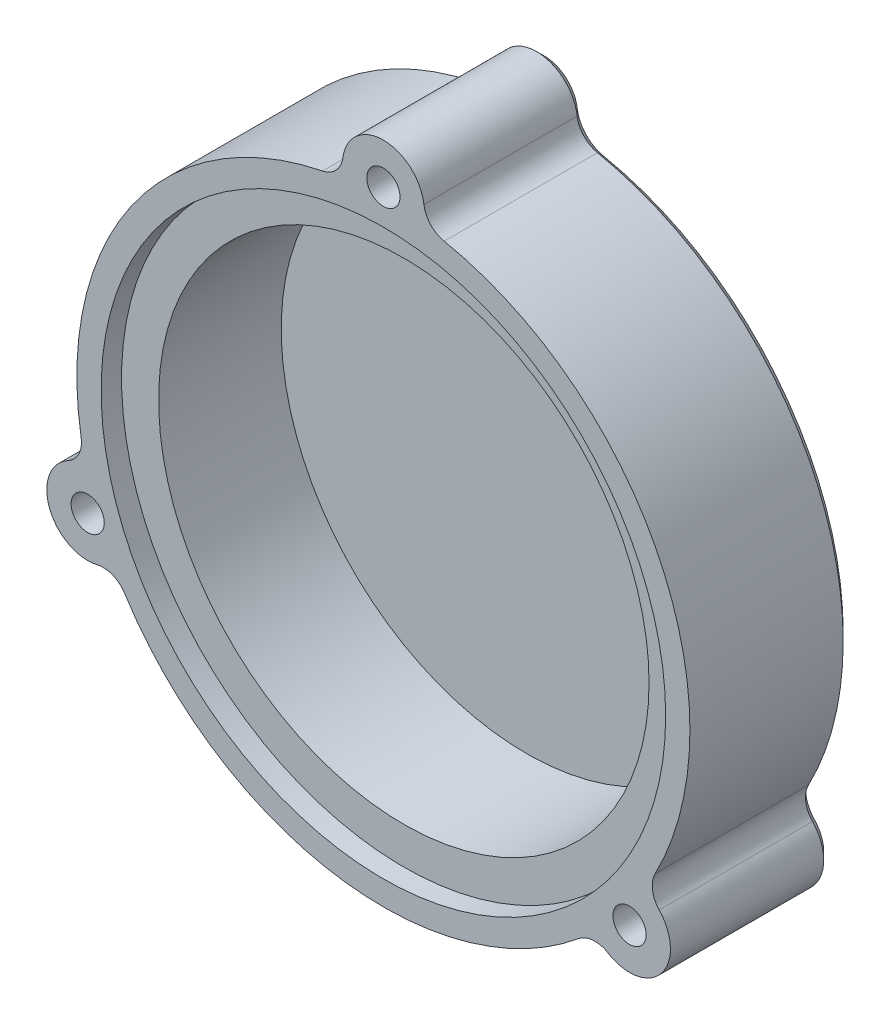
ISO-10303-21;
HEADER;
FILE_DESCRIPTION(('STEP AP214'),'2;1');
FILE_NAME('part.step','',(''),(''),'','','');
FILE_SCHEMA(('AUTOMOTIVE_DESIGN { 1 0 10303 214 1 1 1 1 }'));
ENDSEC;
DATA;
#1=APPLICATION_CONTEXT('core data for automotive mechanical design processes');
#2=APPLICATION_PROTOCOL_DEFINITION('international standard','automotive_design',2000,#1);
#3=PRODUCT_CONTEXT('',#1,'mechanical');
#4=PRODUCT('Part','Part','',(#3));
#5=PRODUCT_RELATED_PRODUCT_CATEGORY('part','',(#4));
#6=PRODUCT_DEFINITION_FORMATION('','',#4);
#7=PRODUCT_DEFINITION_CONTEXT('part definition',#1,'design');
#8=PRODUCT_DEFINITION('design','',#6,#7);
#9=PRODUCT_DEFINITION_SHAPE('','',#8);
#10=(LENGTH_UNIT() NAMED_UNIT(*) SI_UNIT(.MILLI.,.METRE.));
#11=(NAMED_UNIT(*) PLANE_ANGLE_UNIT() SI_UNIT($,.RADIAN.));
#12=(NAMED_UNIT(*) SI_UNIT($,.STERADIAN.) SOLID_ANGLE_UNIT());
#13=UNCERTAINTY_MEASURE_WITH_UNIT(LENGTH_MEASURE(1.E-05),#10,'distance_accuracy_value','');
#14=(GEOMETRIC_REPRESENTATION_CONTEXT(3) GLOBAL_UNCERTAINTY_ASSIGNED_CONTEXT((#13)) GLOBAL_UNIT_ASSIGNED_CONTEXT((#10,
#11,#12)) REPRESENTATION_CONTEXT('',''));
#15=CARTESIAN_POINT('',(0.,0.,0.));
#16=DIRECTION('',(0.,0.,1.));
#17=DIRECTION('',(1.,0.,0.));
#18=AXIS2_PLACEMENT_3D('',#15,#16,#17);
#19=CARTESIAN_POINT('',(-57.8819864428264,-22.2188128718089,0.));
#20=DIRECTION('',(0.,0.,1.));
#21=DIRECTION('',(1.,0.,0.));
#22=AXIS2_PLACEMENT_3D('',#19,#20,#21);
#23=CYLINDRICAL_SURFACE('',#22,3.25);
#24=CARTESIAN_POINT('',(-57.8819864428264,-22.2188128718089,31.5));
#25=DIRECTION('',(0.,0.,1.));
#26=DIRECTION('',(1.,0.,0.));
#27=AXIS2_PLACEMENT_3D('',#24,#25,#26);
#28=CIRCLE('',#27,3.25);
#29=CARTESIAN_POINT('',(-54.6319864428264,-22.2188128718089,31.5));
#30=VERTEX_POINT('',#29);
#31=EDGE_CURVE('E334',#30,#30,#28,.T.);
#32=ORIENTED_EDGE('',*,*,#31,.T.);
#33=EDGE_LOOP('',(#32));
#34=FACE_BOUND('',#33,.T.);
#35=CARTESIAN_POINT('',(-57.8819864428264,-22.2188128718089,15.));
#36=DIRECTION('',(0.,0.,-1.));
#37=DIRECTION('',(-1.,0.,0.));
#38=AXIS2_PLACEMENT_3D('',#35,#36,#37);
#39=CIRCLE('',#38,3.25);
#40=CARTESIAN_POINT('',(-61.1319864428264,-22.2188128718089,15.));
#41=VERTEX_POINT('',#40);
#42=EDGE_CURVE('E329',#41,#41,#39,.F.);
#43=ORIENTED_EDGE('',*,*,#42,.F.);
#44=EDGE_LOOP('',(#43));
#45=FACE_BOUND('',#44,.T.);
#46=ADVANCED_FACE('F41',(#34,#45),#23,.F.);
#47=CARTESIAN_POINT('',(48.183049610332,-39.0178642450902,0.));
#48=DIRECTION('',(0.,0.,1.));
#49=DIRECTION('',(1.,0.,0.));
#50=AXIS2_PLACEMENT_3D('',#47,#48,#49);
#51=CYLINDRICAL_SURFACE('',#50,3.25);
#52=CARTESIAN_POINT('',(48.183049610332,-39.0178642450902,31.5));
#53=DIRECTION('',(0.,0.,1.));
#54=DIRECTION('',(1.,0.,0.));
#55=AXIS2_PLACEMENT_3D('',#52,#53,#54);
#56=CIRCLE('',#55,3.25);
#57=CARTESIAN_POINT('',(51.433049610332,-39.0178642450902,31.5));
#58=VERTEX_POINT('',#57);
#59=EDGE_CURVE('E330',#58,#58,#56,.T.);
#60=ORIENTED_EDGE('',*,*,#59,.T.);
#61=EDGE_LOOP('',(#60));
#62=FACE_BOUND('',#61,.T.);
#63=CARTESIAN_POINT('',(48.183049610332,-39.0178642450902,15.));
#64=DIRECTION('',(0.,0.,-1.));
#65=DIRECTION('',(-1.,0.,0.));
#66=AXIS2_PLACEMENT_3D('',#63,#64,#65);
#67=CIRCLE('',#66,3.25);
#68=CARTESIAN_POINT('',(44.933049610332,-39.0178642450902,15.));
#69=VERTEX_POINT('',#68);
#70=EDGE_CURVE('E366',#69,#69,#67,.F.);
#71=ORIENTED_EDGE('',*,*,#70,.F.);
#72=EDGE_LOOP('',(#71));
#73=FACE_BOUND('',#72,.T.);
#74=ADVANCED_FACE('F375',(#62,#73),#51,.F.);
#75=CARTESIAN_POINT('',(0.,62.,0.));
#76=DIRECTION('',(0.,0.,1.));
#77=DIRECTION('',(1.,0.,0.));
#78=AXIS2_PLACEMENT_3D('',#75,#76,#77);
#79=CYLINDRICAL_SURFACE('',#78,3.25);
#80=CARTESIAN_POINT('',(0.,62.,31.5));
#81=DIRECTION('',(0.,0.,1.));
#82=DIRECTION('',(1.,0.,0.));
#83=AXIS2_PLACEMENT_3D('',#80,#81,#82);
#84=CIRCLE('',#83,3.25);
#85=CARTESIAN_POINT('',(3.25,62.,31.5));
#86=VERTEX_POINT('',#85);
#87=EDGE_CURVE('E333',#86,#86,#84,.T.);
#88=ORIENTED_EDGE('',*,*,#87,.T.);
#89=EDGE_LOOP('',(#88));
#90=FACE_BOUND('',#89,.T.);
#91=CARTESIAN_POINT('',(0.,62.,15.));
#92=DIRECTION('',(0.,0.,-1.));
#93=DIRECTION('',(-1.,0.,0.));
#94=AXIS2_PLACEMENT_3D('',#91,#92,#93);
#95=CIRCLE('',#94,3.25);
#96=CARTESIAN_POINT('',(-3.25,62.,15.));
#97=VERTEX_POINT('',#96);
#98=EDGE_CURVE('E325',#97,#97,#95,.F.);
#99=ORIENTED_EDGE('',*,*,#98,.F.);
#100=EDGE_LOOP('',(#99));
#101=FACE_BOUND('',#100,.T.);
#102=ADVANCED_FACE('F381',(#90,#101),#79,.F.);
#103=CARTESIAN_POINT('',(0.,62.,31.5));
#104=DIRECTION('',(0.,0.,-1.));
#105=DIRECTION('',(-1.,0.,0.));
#106=AXIS2_PLACEMENT_3D('',#103,#104,#105);
#107=CYLINDRICAL_SURFACE('',#106,8.);
#108=DIRECTION('',(0.,0.,-1.));
#109=VECTOR('',#108,1.);
#110=CARTESIAN_POINT('',(7.93051488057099,63.0521091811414,31.5));
#111=LINE('',#110,#109);
#112=CARTESIAN_POINT('',(7.93051488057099,63.0521091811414,31.5));
#113=VERTEX_POINT('',#112);
#114=CARTESIAN_POINT('',(7.93051488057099,63.0521091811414,1.49999999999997));
#115=VERTEX_POINT('',#114);
#116=EDGE_CURVE('E216',#113,#115,#111,.T.);
#117=ORIENTED_EDGE('',*,*,#116,.T.);
#118=CARTESIAN_POINT('',(0.,62.,1.49999999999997));
#119=DIRECTION('',(0.,0.,1.));
#120=DIRECTION('',(1.,0.,0.));
#121=AXIS2_PLACEMENT_3D('',#118,#119,#120);
#122=CIRCLE('',#121,8.);
#123=CARTESIAN_POINT('',(-7.93051488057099,63.0521091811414,1.49999999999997));
#124=VERTEX_POINT('',#123);
#125=EDGE_CURVE('E268',#115,#124,#122,.T.);
#126=ORIENTED_EDGE('',*,*,#125,.T.);
#127=DIRECTION('',(0.,0.,-1.));
#128=VECTOR('',#127,1.);
#129=CARTESIAN_POINT('',(-7.93051488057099,63.0521091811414,31.5));
#130=LINE('',#129,#128);
#131=CARTESIAN_POINT('',(-7.93051488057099,63.0521091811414,31.5));
#132=VERTEX_POINT('',#131);
#133=EDGE_CURVE('E180',#124,#132,#130,.F.);
#134=ORIENTED_EDGE('',*,*,#133,.T.);
#135=CARTESIAN_POINT('',(0.,62.,31.5));
#136=DIRECTION('',(0.,0.,1.));
#137=DIRECTION('',(1.,0.,0.));
#138=AXIS2_PLACEMENT_3D('',#135,#136,#137);
#139=CIRCLE('',#138,8.);
#140=EDGE_CURVE('E346',#113,#132,#139,.T.);
#141=ORIENTED_EDGE('',*,*,#140,.F.);
#142=EDGE_LOOP('',(#117,#126,#134,#141));
#143=FACE_BOUND('',#142,.T.);
#144=ADVANCED_FACE('F388',(#143),#107,.T.);
#145=CARTESIAN_POINT('',(0.,0.,31.5));
#146=DIRECTION('',(0.,0.,-1.));
#147=DIRECTION('',(-1.,0.,0.));
#148=AXIS2_PLACEMENT_3D('',#145,#146,#147);
#149=CYLINDRICAL_SURFACE('',#148,60.);
#150=DIRECTION('',(0.,0.,-1.));
#151=VECTOR('',#150,1.);
#152=CARTESIAN_POINT('',(-11.8957723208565,58.8089330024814,31.5));
#153=LINE('',#152,#151);
#154=CARTESIAN_POINT('',(-11.8957723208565,58.8089330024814,31.5));
#155=VERTEX_POINT('',#154);
#156=CARTESIAN_POINT('',(-11.8957723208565,58.8089330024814,1.49999999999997));
#157=VERTEX_POINT('',#156);
#158=EDGE_CURVE('E212',#155,#157,#153,.T.);
#159=ORIENTED_EDGE('',*,*,#158,.T.);
#160=CARTESIAN_POINT('',(0.,0.,1.49999999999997));
#161=DIRECTION('',(0.,0.,1.));
#162=DIRECTION('',(1.,0.,0.));
#163=AXIS2_PLACEMENT_3D('',#160,#161,#162);
#164=CIRCLE('',#163,60.);
#165=CARTESIAN_POINT('',(-59.165932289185,-9.96957653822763,1.49999999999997));
#166=VERTEX_POINT('',#165);
#167=EDGE_CURVE('E11',#157,#166,#164,.T.);
#168=ORIENTED_EDGE('',*,*,#167,.T.);
#169=DIRECTION('',(0.,0.,-1.));
#170=VECTOR('',#169,1.);
#171=CARTESIAN_POINT('',(-59.165932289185,-9.96957653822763,31.5));
#172=LINE('',#171,#170);
#173=CARTESIAN_POINT('',(-59.165932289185,-9.96957653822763,31.5));
#174=VERTEX_POINT('',#173);
#175=EDGE_CURVE('E214',#166,#174,#172,.F.);
#176=ORIENTED_EDGE('',*,*,#175,.T.);
#177=CARTESIAN_POINT('',(0.,0.,31.5));
#178=DIRECTION('',(0.,0.,1.));
#179=DIRECTION('',(1.,0.,0.));
#180=AXIS2_PLACEMENT_3D('',#177,#178,#179);
#181=CIRCLE('',#180,60.);
#182=EDGE_CURVE('E352',#155,#174,#181,.T.);
#183=ORIENTED_EDGE('',*,*,#182,.F.);
#184=EDGE_LOOP('',(#159,#168,#176,#183));
#185=FACE_BOUND('',#184,.T.);
#186=ADVANCED_FACE('F427',(#185),#149,.T.);
#187=CARTESIAN_POINT('',(-57.8819864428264,-22.2188128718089,31.5));
#188=DIRECTION('',(0.,0.,-1.));
#189=DIRECTION('',(-1.,0.,0.));
#190=AXIS2_PLACEMENT_3D('',#187,#188,#189);
#191=CYLINDRICAL_SURFACE('',#190,8.);
#192=DIRECTION('',(0.,0.,-1.));
#193=VECTOR('',#192,1.);
#194=CARTESIAN_POINT('',(-61.7062573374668,-15.1920816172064,31.5));
#195=LINE('',#194,#193);
#196=CARTESIAN_POINT('',(-61.7062573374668,-15.1920816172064,31.5));
#197=VERTEX_POINT('',#196);
#198=CARTESIAN_POINT('',(-61.7062573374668,-15.1920816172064,1.49999999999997));
#199=VERTEX_POINT('',#198);
#200=EDGE_CURVE('E209',#197,#199,#195,.T.);
#201=ORIENTED_EDGE('',*,*,#200,.T.);
#202=CARTESIAN_POINT('',(-57.8819864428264,-22.2188128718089,1.49999999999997));
#203=DIRECTION('',(0.,0.,1.));
#204=DIRECTION('',(1.,0.,0.));
#205=AXIS2_PLACEMENT_3D('',#202,#203,#204);
#206=CIRCLE('',#205,8.);
#207=CARTESIAN_POINT('',(-56.0221726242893,-29.9996285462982,1.49999999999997));
#208=VERTEX_POINT('',#207);
#209=EDGE_CURVE('E270',#199,#208,#206,.T.);
#210=ORIENTED_EDGE('',*,*,#209,.T.);
#211=DIRECTION('',(0.,0.,-1.));
#212=VECTOR('',#211,1.);
#213=CARTESIAN_POINT('',(-56.0221726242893,-29.9996285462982,31.5));
#214=LINE('',#213,#212);
#215=CARTESIAN_POINT('',(-56.0221726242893,-29.9996285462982,31.5));
#216=VERTEX_POINT('',#215);
#217=EDGE_CURVE('E207',#208,#216,#214,.F.);
#218=ORIENTED_EDGE('',*,*,#217,.T.);
#219=CARTESIAN_POINT('',(-57.8819864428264,-22.2188128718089,31.5));
#220=DIRECTION('',(0.,0.,1.));
#221=DIRECTION('',(1.,0.,0.));
#222=AXIS2_PLACEMENT_3D('',#219,#220,#221);
#223=CIRCLE('',#222,8.);
#224=EDGE_CURVE('E355',#197,#216,#223,.T.);
#225=ORIENTED_EDGE('',*,*,#224,.F.);
#226=EDGE_LOOP('',(#201,#210,#218,#225));
#227=FACE_BOUND('',#226,.T.);
#228=ADVANCED_FACE('F423',(#227),#191,.T.);
#229=CARTESIAN_POINT('',(0.,0.,31.5));
#230=DIRECTION('',(0.,0.,-1.));
#231=DIRECTION('',(-1.,0.,0.));
#232=AXIS2_PLACEMENT_3D('',#229,#230,#231);
#233=CYLINDRICAL_SURFACE('',#232,60.);
#234=DIRECTION('',(0.,0.,-1.));
#235=VECTOR('',#234,1.);
#236=CARTESIAN_POINT('',(-50.6398052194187,-32.1808969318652,31.5));
#237=LINE('',#236,#235);
#238=CARTESIAN_POINT('',(-50.6398052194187,-32.1808969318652,31.5));
#239=VERTEX_POINT('',#238);
#240=CARTESIAN_POINT('',(-50.6398052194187,-32.1808969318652,1.49999999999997));
#241=VERTEX_POINT('',#240);
#242=EDGE_CURVE('E202',#239,#241,#237,.T.);
#243=ORIENTED_EDGE('',*,*,#242,.T.);
#244=CARTESIAN_POINT('',(0.,0.,1.49999999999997));
#245=DIRECTION('',(0.,0.,1.));
#246=DIRECTION('',(1.,0.,0.));
#247=AXIS2_PLACEMENT_3D('',#244,#245,#246);
#248=CIRCLE('',#247,60.);
#249=CARTESIAN_POINT('',(38.2168726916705,-46.2544121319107,1.49999999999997));
#250=VERTEX_POINT('',#249);
#251=EDGE_CURVE('E262',#241,#250,#248,.T.);
#252=ORIENTED_EDGE('',*,*,#251,.T.);
#253=DIRECTION('',(0.,0.,-1.));
#254=VECTOR('',#253,1.);
#255=CARTESIAN_POINT('',(38.2168726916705,-46.2544121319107,31.5));
#256=LINE('',#255,#254);
#257=CARTESIAN_POINT('',(38.2168726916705,-46.2544121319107,31.5));
#258=VERTEX_POINT('',#257);
#259=EDGE_CURVE('E205',#250,#258,#256,.F.);
#260=ORIENTED_EDGE('',*,*,#259,.T.);
#261=CARTESIAN_POINT('',(0.,0.,31.5));
#262=DIRECTION('',(0.,0.,1.));
#263=DIRECTION('',(1.,0.,0.));
#264=AXIS2_PLACEMENT_3D('',#261,#262,#263);
#265=CIRCLE('',#264,60.);
#266=EDGE_CURVE('E358',#239,#258,#265,.T.);
#267=ORIENTED_EDGE('',*,*,#266,.F.);
#268=EDGE_LOOP('',(#243,#252,#260,#267));
#269=FACE_BOUND('',#268,.T.);
#270=ADVANCED_FACE('F419',(#269),#233,.T.);
#271=CARTESIAN_POINT('',(48.183049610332,-39.0178642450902,31.5));
#272=DIRECTION('',(0.,0.,-1.));
#273=DIRECTION('',(-1.,0.,0.));
#274=AXIS2_PLACEMENT_3D('',#271,#272,#273);
#275=CYLINDRICAL_SURFACE('',#274,8.);
#276=DIRECTION('',(0.,0.,-1.));
#277=VECTOR('',#276,1.);
#278=CARTESIAN_POINT('',(44.0098572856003,-45.8431456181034,31.5));
#279=LINE('',#278,#277);
#280=CARTESIAN_POINT('',(44.0098572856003,-45.8431456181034,31.5));
#281=VERTEX_POINT('',#280);
#282=CARTESIAN_POINT('',(44.0098572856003,-45.8431456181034,1.49999999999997));
#283=VERTEX_POINT('',#282);
#284=EDGE_CURVE('E193',#281,#283,#279,.T.);
#285=ORIENTED_EDGE('',*,*,#284,.T.);
#286=CARTESIAN_POINT('',(48.183049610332,-39.0178642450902,1.49999999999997));
#287=DIRECTION('',(0.,0.,1.));
#288=DIRECTION('',(1.,0.,0.));
#289=AXIS2_PLACEMENT_3D('',#286,#287,#288);
#290=CIRCLE('',#289,8.);
#291=CARTESIAN_POINT('',(53.9915267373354,-33.5168103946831,1.49999999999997));
#292=VERTEX_POINT('',#291);
#293=EDGE_CURVE('E229',#283,#292,#290,.T.);
#294=ORIENTED_EDGE('',*,*,#293,.T.);
#295=DIRECTION('',(0.,0.,-1.));
#296=VECTOR('',#295,1.);
#297=CARTESIAN_POINT('',(53.9915267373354,-33.5168103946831,31.5));
#298=LINE('',#297,#296);
#299=CARTESIAN_POINT('',(53.9915267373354,-33.5168103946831,31.5));
#300=VERTEX_POINT('',#299);
#301=EDGE_CURVE('E196',#292,#300,#298,.F.);
#302=ORIENTED_EDGE('',*,*,#301,.T.);
#303=CARTESIAN_POINT('',(48.183049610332,-39.0178642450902,31.5));
#304=DIRECTION('',(0.,0.,1.));
#305=DIRECTION('',(1.,0.,0.));
#306=AXIS2_PLACEMENT_3D('',#303,#304,#305);
#307=CIRCLE('',#306,8.);
#308=EDGE_CURVE('E175',#281,#300,#307,.T.);
#309=ORIENTED_EDGE('',*,*,#308,.F.);
#310=EDGE_LOOP('',(#285,#294,#302,#309));
#311=FACE_BOUND('',#310,.T.);
#312=ADVANCED_FACE('F416',(#311),#275,.T.);
#313=CARTESIAN_POINT('',(0.,0.,31.5));
#314=DIRECTION('',(0.,0.,-1.));
#315=DIRECTION('',(-1.,0.,0.));
#316=AXIS2_PLACEMENT_3D('',#313,#314,#315);
#317=CYLINDRICAL_SURFACE('',#316,60.);
#318=DIRECTION('',(0.,0.,-1.));
#319=VECTOR('',#318,1.);
#320=CARTESIAN_POINT('',(53.1893768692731,-27.7649092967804,31.5));
#321=LINE('',#320,#319);
#322=CARTESIAN_POINT('',(53.1893768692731,-27.7649092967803,31.5));
#323=VERTEX_POINT('',#322);
#324=CARTESIAN_POINT('',(53.1893768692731,-27.7649092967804,1.49999999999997));
#325=VERTEX_POINT('',#324);
#326=EDGE_CURVE('E185',#323,#325,#321,.T.);
#327=ORIENTED_EDGE('',*,*,#326,.T.);
#328=CARTESIAN_POINT('',(0.,0.,1.49999999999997));
#329=DIRECTION('',(0.,0.,1.));
#330=DIRECTION('',(1.,0.,0.));
#331=AXIS2_PLACEMENT_3D('',#328,#329,#330);
#332=CIRCLE('',#331,60.);
#333=CARTESIAN_POINT('',(11.8957723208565,58.8089330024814,1.49999999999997));
#334=VERTEX_POINT('',#333);
#335=EDGE_CURVE('E260',#325,#334,#332,.T.);
#336=ORIENTED_EDGE('',*,*,#335,.T.);
#337=DIRECTION('',(0.,0.,-1.));
#338=VECTOR('',#337,1.);
#339=CARTESIAN_POINT('',(11.8957723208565,58.8089330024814,31.5));
#340=LINE('',#339,#338);
#341=CARTESIAN_POINT('',(11.8957723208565,58.8089330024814,31.5));
#342=VERTEX_POINT('',#341);
#343=EDGE_CURVE('E188',#334,#342,#340,.F.);
#344=ORIENTED_EDGE('',*,*,#343,.T.);
#345=CARTESIAN_POINT('',(0.,0.,31.5));
#346=DIRECTION('',(0.,0.,1.));
#347=DIRECTION('',(1.,0.,0.));
#348=AXIS2_PLACEMENT_3D('',#345,#346,#347);
#349=CIRCLE('',#348,60.);
#350=EDGE_CURVE('E172',#323,#342,#349,.T.);
#351=ORIENTED_EDGE('',*,*,#350,.F.);
#352=EDGE_LOOP('',(#327,#336,#344,#351));
#353=FACE_BOUND('',#352,.T.);
#354=ADVANCED_FACE('F184',(#353),#317,.T.);
#355=CARTESIAN_POINT('',(0.,31.,31.5));
#356=DIRECTION('',(0.,0.,1.));
#357=DIRECTION('',(1.,0.,0.));
#358=AXIS2_PLACEMENT_3D('',#355,#356,#357);
#359=PLANE('',#358);
#360=ORIENTED_EDGE('',*,*,#59,.F.);
#361=EDGE_LOOP('',(#360));
#362=FACE_BOUND('',#361,.T.);
#363=ORIENTED_EDGE('',*,*,#31,.F.);
#364=EDGE_LOOP('',(#363));
#365=FACE_BOUND('',#364,.T.);
#366=ORIENTED_EDGE('',*,*,#87,.F.);
#367=EDGE_LOOP('',(#366));
#368=FACE_BOUND('',#367,.T.);
#369=CARTESIAN_POINT('',(0.,0.,31.5));
#370=DIRECTION('',(0.,0.,1.));
#371=DIRECTION('',(1.,0.,0.));
#372=AXIS2_PLACEMENT_3D('',#369,#370,#371);
#373=CIRCLE('',#372,55.25);
#374=CARTESIAN_POINT('',(55.25,0.,31.5));
#375=VERTEX_POINT('',#374);
#376=EDGE_CURVE('E347',#375,#375,#373,.T.);
#377=ORIENTED_EDGE('',*,*,#376,.F.);
#378=EDGE_LOOP('',(#377));
#379=FACE_BOUND('',#378,.T.);
#380=ORIENTED_EDGE('',*,*,#350,.T.);
#381=CARTESIAN_POINT('',(12.8870866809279,63.7096774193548,31.5));
#382=DIRECTION('',(0.,0.,1.));
#383=DIRECTION('',(1.,0.,0.));
#384=AXIS2_PLACEMENT_3D('',#381,#382,#383);
#385=CIRCLE('',#384,5.);
#386=EDGE_CURVE('E227',#342,#113,#385,.F.);
#387=ORIENTED_EDGE('',*,*,#386,.T.);
#388=ORIENTED_EDGE('',*,*,#140,.T.);
#389=CARTESIAN_POINT('',(-12.8870866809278,63.7096774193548,31.5));
#390=DIRECTION('',(0.,0.,1.));
#391=DIRECTION('',(1.,0.,0.));
#392=AXIS2_PLACEMENT_3D('',#389,#390,#391);
#393=CIRCLE('',#392,5.);
#394=EDGE_CURVE('E225',#132,#155,#393,.F.);
#395=ORIENTED_EDGE('',*,*,#394,.T.);
#396=ORIENTED_EDGE('',*,*,#182,.T.);
#397=CARTESIAN_POINT('',(-64.0964266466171,-10.8003745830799,31.5));
#398=DIRECTION('',(0.,0.,1.));
#399=DIRECTION('',(1.,0.,0.));
#400=AXIS2_PLACEMENT_3D('',#397,#398,#399);
#401=CIRCLE('',#400,5.);
#402=EDGE_CURVE('E221',#174,#197,#401,.F.);
#403=ORIENTED_EDGE('',*,*,#402,.T.);
#404=ORIENTED_EDGE('',*,*,#224,.T.);
#405=CARTESIAN_POINT('',(-54.8597889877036,-34.8626383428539,31.5));
#406=DIRECTION('',(0.,0.,1.));
#407=DIRECTION('',(1.,0.,0.));
#408=AXIS2_PLACEMENT_3D('',#405,#406,#407);
#409=CIRCLE('',#408,5.);
#410=EDGE_CURVE('E223',#216,#239,#409,.F.);
#411=ORIENTED_EDGE('',*,*,#410,.T.);
#412=ORIENTED_EDGE('',*,*,#266,.T.);
#413=CARTESIAN_POINT('',(41.4016120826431,-50.1089464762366,31.5));
#414=DIRECTION('',(0.,0.,1.));
#415=DIRECTION('',(1.,0.,0.));
#416=AXIS2_PLACEMENT_3D('',#413,#414,#415);
#417=CIRCLE('',#416,5.);
#418=EDGE_CURVE('E179',#258,#281,#417,.F.);
#419=ORIENTED_EDGE('',*,*,#418,.T.);
#420=ORIENTED_EDGE('',*,*,#308,.T.);
#421=CARTESIAN_POINT('',(57.6218249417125,-30.0786517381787,31.5));
#422=DIRECTION('',(0.,0.,1.));
#423=DIRECTION('',(1.,0.,0.));
#424=AXIS2_PLACEMENT_3D('',#421,#422,#423);
#425=CIRCLE('',#424,5.);
#426=EDGE_CURVE('E169',#300,#323,#425,.F.);
#427=ORIENTED_EDGE('',*,*,#426,.T.);
#428=EDGE_LOOP('',(#380,#387,#388,#395,#396,#403,#404,#411,#412,#419,#420,#427));
#429=FACE_BOUND('',#428,.T.);
#430=ADVANCED_FACE('F171',(#362,#365,#368,#379,#429),#359,.T.);
#431=CARTESIAN_POINT('',(0.,31.,0.));
#432=DIRECTION('',(0.,0.,1.));
#433=DIRECTION('',(1.,0.,0.));
#434=AXIS2_PLACEMENT_3D('',#431,#432,#433);
#435=PLANE('',#434);
#436=CARTESIAN_POINT('',(57.6218249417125,-30.0786517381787,0.));
#437=DIRECTION('',(0.,0.,1.));
#438=DIRECTION('',(1.,0.,0.));
#439=AXIS2_PLACEMENT_3D('',#436,#437,#438);
#440=CIRCLE('',#439,6.49999999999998);
#441=CARTESIAN_POINT('',(51.8596424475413,-27.0707865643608,0.));
#442=VERTEX_POINT('',#441);
#443=CARTESIAN_POINT('',(52.9024372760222,-34.5482579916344,0.));
#444=VERTEX_POINT('',#443);
#445=EDGE_CURVE('E252',#442,#444,#440,.T.);
#446=ORIENTED_EDGE('',*,*,#445,.T.);
#447=CARTESIAN_POINT('',(48.183049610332,-39.0178642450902,0.));
#448=DIRECTION('',(0.,0.,1.));
#449=DIRECTION('',(1.,0.,0.));
#450=AXIS2_PLACEMENT_3D('',#447,#448,#449);
#451=CIRCLE('',#450,6.50000000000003);
#452=CARTESIAN_POINT('',(44.7923308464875,-44.5634053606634,0.));
#453=VERTEX_POINT('',#452);
#454=EDGE_CURVE('E254',#444,#453,#451,.F.);
#455=ORIENTED_EDGE('',*,*,#454,.T.);
#456=CARTESIAN_POINT('',(41.4016120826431,-50.1089464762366,0.));
#457=DIRECTION('',(0.,0.,1.));
#458=DIRECTION('',(1.,0.,0.));
#459=AXIS2_PLACEMENT_3D('',#456,#457,#458);
#460=CIRCLE('',#459,6.49999999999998);
#461=CARTESIAN_POINT('',(37.2614508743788,-45.098051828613,0.));
#462=VERTEX_POINT('',#461);
#463=EDGE_CURVE('E250',#453,#462,#460,.T.);
#464=ORIENTED_EDGE('',*,*,#463,.T.);
#465=CARTESIAN_POINT('',(0.,0.,0.));
#466=DIRECTION('',(0.,0.,1.));
#467=DIRECTION('',(1.,0.,0.));
#468=AXIS2_PLACEMENT_3D('',#465,#466,#467);
#469=CIRCLE('',#468,58.5);
#470=CARTESIAN_POINT('',(-49.3738100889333,-31.3763745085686,0.));
#471=VERTEX_POINT('',#470);
#472=EDGE_CURVE('E246',#462,#471,#469,.F.);
#473=ORIENTED_EDGE('',*,*,#472,.T.);
#474=CARTESIAN_POINT('',(-54.8597889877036,-34.8626383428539,0.));
#475=DIRECTION('',(0.,0.,1.));
#476=DIRECTION('',(1.,0.,0.));
#477=AXIS2_PLACEMENT_3D('',#474,#475,#476);
#478=CIRCLE('',#477,6.49999999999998);
#479=CARTESIAN_POINT('',(-56.370887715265,-28.5407256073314,0.));
#480=VERTEX_POINT('',#479);
#481=EDGE_CURVE('E242',#471,#480,#478,.T.);
#482=ORIENTED_EDGE('',*,*,#481,.T.);
#483=CARTESIAN_POINT('',(-57.8819864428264,-22.2188128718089,0.));
#484=DIRECTION('',(0.,0.,1.));
#485=DIRECTION('',(1.,0.,0.));
#486=AXIS2_PLACEMENT_3D('',#483,#484,#485);
#487=CIRCLE('',#486,6.50000000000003);
#488=CARTESIAN_POINT('',(-60.9892065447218,-16.5095937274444,0.));
#489=VERTEX_POINT('',#488);
#490=EDGE_CURVE('E238',#480,#489,#487,.F.);
#491=ORIENTED_EDGE('',*,*,#490,.T.);
#492=CARTESIAN_POINT('',(-64.0964266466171,-10.8003745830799,0.));
#493=DIRECTION('',(0.,0.,1.));
#494=DIRECTION('',(1.,0.,0.));
#495=AXIS2_PLACEMENT_3D('',#492,#493,#494);
#496=CIRCLE('',#495,6.49999999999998);
#497=CARTESIAN_POINT('',(-57.6867839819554,-9.72033712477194,0.));
#498=VERTEX_POINT('',#497);
#499=EDGE_CURVE('E234',#489,#498,#496,.T.);
#500=ORIENTED_EDGE('',*,*,#499,.T.);
#501=CARTESIAN_POINT('',(0.,0.,0.));
#502=DIRECTION('',(0.,0.,1.));
#503=DIRECTION('',(1.,0.,0.));
#504=AXIS2_PLACEMENT_3D('',#501,#502,#503);
#505=CIRCLE('',#504,58.5);
#506=CARTESIAN_POINT('',(-11.598378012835,57.3387096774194,0.));
#507=VERTEX_POINT('',#506);
#508=EDGE_CURVE('E232',#498,#507,#505,.F.);
#509=ORIENTED_EDGE('',*,*,#508,.T.);
#510=CARTESIAN_POINT('',(-12.8870866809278,63.7096774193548,0.));
#511=DIRECTION('',(0.,0.,1.));
#512=DIRECTION('',(1.,0.,0.));
#513=AXIS2_PLACEMENT_3D('',#510,#511,#512);
#514=CIRCLE('',#513,6.49999999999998);
#515=CARTESIAN_POINT('',(-6.44354334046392,62.8548387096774,0.));
#516=VERTEX_POINT('',#515);
#517=EDGE_CURVE('E236',#507,#516,#514,.T.);
#518=ORIENTED_EDGE('',*,*,#517,.T.);
#519=CARTESIAN_POINT('',(0.,62.,0.));
#520=DIRECTION('',(0.,0.,1.));
#521=DIRECTION('',(1.,0.,0.));
#522=AXIS2_PLACEMENT_3D('',#519,#520,#521);
#523=CIRCLE('',#522,6.50000000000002);
#524=CARTESIAN_POINT('',(6.44354334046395,62.8548387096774,0.));
#525=VERTEX_POINT('',#524);
#526=EDGE_CURVE('E240',#516,#525,#523,.F.);
#527=ORIENTED_EDGE('',*,*,#526,.T.);
#528=CARTESIAN_POINT('',(12.8870866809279,63.7096774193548,0.));
#529=DIRECTION('',(0.,0.,1.));
#530=DIRECTION('',(1.,0.,0.));
#531=AXIS2_PLACEMENT_3D('',#528,#529,#530);
#532=CIRCLE('',#531,6.49999999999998);
#533=CARTESIAN_POINT('',(11.5983780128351,57.3387096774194,0.));
#534=VERTEX_POINT('',#533);
#535=EDGE_CURVE('E244',#525,#534,#532,.T.);
#536=ORIENTED_EDGE('',*,*,#535,.T.);
#537=CARTESIAN_POINT('',(0.,0.,0.));
#538=DIRECTION('',(0.,0.,1.));
#539=DIRECTION('',(1.,0.,0.));
#540=AXIS2_PLACEMENT_3D('',#537,#538,#539);
#541=CIRCLE('',#540,58.5);
#542=EDGE_CURVE('E248',#534,#442,#541,.F.);
#543=ORIENTED_EDGE('',*,*,#542,.T.);
#544=EDGE_LOOP('',(#446,#455,#464,#473,#482,#491,#500,#509,#518,#527,#536,#543));
#545=FACE_BOUND('',#544,.T.);
#546=CARTESIAN_POINT('',(-57.8819864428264,-22.2188128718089,0.));
#547=DIRECTION('',(0.,0.,-1.));
#548=DIRECTION('',(-1.,0.,0.));
#549=AXIS2_PLACEMENT_3D('',#546,#547,#548);
#550=CIRCLE('',#549,4.75);
#551=CARTESIAN_POINT('',(-62.6319864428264,-22.2188128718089,0.));
#552=VERTEX_POINT('',#551);
#553=EDGE_CURVE('E318',#552,#552,#550,.T.);
#554=ORIENTED_EDGE('',*,*,#553,.F.);
#555=EDGE_LOOP('',(#554));
#556=FACE_BOUND('',#555,.T.);
#557=CARTESIAN_POINT('',(48.183049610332,-39.0178642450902,0.));
#558=DIRECTION('',(0.,0.,-1.));
#559=DIRECTION('',(-1.,0.,0.));
#560=AXIS2_PLACEMENT_3D('',#557,#558,#559);
#561=CIRCLE('',#560,4.75000000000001);
#562=CARTESIAN_POINT('',(43.433049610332,-39.0178642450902,0.));
#563=VERTEX_POINT('',#562);
#564=EDGE_CURVE('E307',#563,#563,#561,.T.);
#565=ORIENTED_EDGE('',*,*,#564,.F.);
#566=EDGE_LOOP('',(#565));
#567=FACE_BOUND('',#566,.T.);
#568=CARTESIAN_POINT('',(0.,62.,0.));
#569=DIRECTION('',(0.,0.,-1.));
#570=DIRECTION('',(-1.,0.,0.));
#571=AXIS2_PLACEMENT_3D('',#568,#569,#570);
#572=CIRCLE('',#571,4.75);
#573=CARTESIAN_POINT('',(-4.75,62.,0.));
#574=VERTEX_POINT('',#573);
#575=EDGE_CURVE('E326',#574,#574,#572,.T.);
#576=ORIENTED_EDGE('',*,*,#575,.F.);
#577=EDGE_LOOP('',(#576));
#578=FACE_BOUND('',#577,.T.);
#579=ADVANCED_FACE('F406',(#545,#556,#567,#578),#435,.F.);
#580=CARTESIAN_POINT('',(0.,0.,27.5));
#581=DIRECTION('',(0.,0.,1.));
#582=DIRECTION('',(1.,0.,0.));
#583=AXIS2_PLACEMENT_3D('',#580,#581,#582);
#584=CYLINDRICAL_SURFACE('',#583,55.25);
#585=CARTESIAN_POINT('',(0.,0.,27.5));
#586=DIRECTION('',(0.,0.,1.));
#587=DIRECTION('',(1.,0.,0.));
#588=AXIS2_PLACEMENT_3D('',#585,#586,#587);
#589=CIRCLE('',#588,55.25);
#590=CARTESIAN_POINT('',(55.25,0.,27.5));
#591=VERTEX_POINT('',#590);
#592=EDGE_CURVE('E343',#591,#591,#589,.T.);
#593=ORIENTED_EDGE('',*,*,#592,.F.);
#594=EDGE_LOOP('',(#593));
#595=FACE_BOUND('',#594,.T.);
#596=ORIENTED_EDGE('',*,*,#376,.T.);
#597=EDGE_LOOP('',(#596));
#598=FACE_BOUND('',#597,.T.);
#599=ADVANCED_FACE('F402',(#595,#598),#584,.F.);
#600=CARTESIAN_POINT('',(0.,0.,27.5));
#601=DIRECTION('',(0.,0.,1.));
#602=DIRECTION('',(1.,0.,0.));
#603=AXIS2_PLACEMENT_3D('',#600,#601,#602);
#604=PLANE('',#603);
#605=CARTESIAN_POINT('',(0.,0.,27.5));
#606=DIRECTION('',(0.,0.,1.));
#607=DIRECTION('',(1.,0.,0.));
#608=AXIS2_PLACEMENT_3D('',#605,#606,#607);
#609=CIRCLE('',#608,48.);
#610=CARTESIAN_POINT('',(48.,0.,27.5));
#611=VERTEX_POINT('',#610);
#612=EDGE_CURVE('E342',#611,#611,#609,.T.);
#613=ORIENTED_EDGE('',*,*,#612,.F.);
#614=EDGE_LOOP('',(#613));
#615=FACE_BOUND('',#614,.T.);
#616=ORIENTED_EDGE('',*,*,#592,.T.);
#617=EDGE_LOOP('',(#616));
#618=FACE_BOUND('',#617,.T.);
#619=ADVANCED_FACE('F398',(#615,#618),#604,.T.);
#620=CARTESIAN_POINT('',(0.,0.,3.5));
#621=DIRECTION('',(0.,0.,1.));
#622=DIRECTION('',(1.,0.,0.));
#623=AXIS2_PLACEMENT_3D('',#620,#621,#622);
#624=CYLINDRICAL_SURFACE('',#623,48.);
#625=ORIENTED_EDGE('',*,*,#612,.T.);
#626=EDGE_LOOP('',(#625));
#627=FACE_BOUND('',#626,.T.);
#628=CARTESIAN_POINT('',(0.,0.,3.5));
#629=DIRECTION('',(0.,0.,1.));
#630=DIRECTION('',(1.,0.,0.));
#631=AXIS2_PLACEMENT_3D('',#628,#629,#630);
#632=CIRCLE('',#631,48.);
#633=CARTESIAN_POINT('',(48.,0.,3.5));
#634=VERTEX_POINT('',#633);
#635=EDGE_CURVE('E339',#634,#634,#632,.T.);
#636=ORIENTED_EDGE('',*,*,#635,.F.);
#637=EDGE_LOOP('',(#636));
#638=FACE_BOUND('',#637,.T.);
#639=ADVANCED_FACE('F394',(#627,#638),#624,.F.);
#640=CARTESIAN_POINT('',(0.,0.,3.5));
#641=DIRECTION('',(0.,0.,1.));
#642=DIRECTION('',(1.,0.,0.));
#643=AXIS2_PLACEMENT_3D('',#640,#641,#642);
#644=PLANE('',#643);
#645=ORIENTED_EDGE('',*,*,#635,.T.);
#646=EDGE_LOOP('',(#645));
#647=FACE_BOUND('',#646,.T.);
#648=ADVANCED_FACE('F390',(#647),#644,.T.);
#649=CARTESIAN_POINT('',(0.,62.,15.));
#650=DIRECTION('',(0.,0.,-1.));
#651=DIRECTION('',(-1.,0.,0.));
#652=AXIS2_PLACEMENT_3D('',#649,#650,#651);
#653=PLANE('',#652);
#654=CARTESIAN_POINT('',(0.,62.,15.));
#655=DIRECTION('',(0.,0.,-1.));
#656=DIRECTION('',(-1.,0.,0.));
#657=AXIS2_PLACEMENT_3D('',#654,#655,#656);
#658=CIRCLE('',#657,4.75);
#659=CARTESIAN_POINT('',(-4.75,62.,15.));
#660=VERTEX_POINT('',#659);
#661=EDGE_CURVE('E322',#660,#660,#658,.T.);
#662=ORIENTED_EDGE('',*,*,#661,.T.);
#663=EDGE_LOOP('',(#662));
#664=FACE_BOUND('',#663,.T.);
#665=ORIENTED_EDGE('',*,*,#98,.T.);
#666=EDGE_LOOP('',(#665));
#667=FACE_BOUND('',#666,.T.);
#668=ADVANCED_FACE('F393',(#664,#667),#653,.T.);
#669=CARTESIAN_POINT('',(0.,62.,15.));
#670=DIRECTION('',(0.,0.,-1.));
#671=DIRECTION('',(-1.,0.,0.));
#672=AXIS2_PLACEMENT_3D('',#669,#670,#671);
#673=CYLINDRICAL_SURFACE('',#672,4.75);
#674=ORIENTED_EDGE('',*,*,#661,.F.);
#675=EDGE_LOOP('',(#674));
#676=FACE_BOUND('',#675,.T.);
#677=ORIENTED_EDGE('',*,*,#575,.T.);
#678=EDGE_LOOP('',(#677));
#679=FACE_BOUND('',#678,.T.);
#680=ADVANCED_FACE('F550',(#676,#679),#673,.F.);
#681=CARTESIAN_POINT('',(48.183049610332,-39.0178642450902,15.));
#682=DIRECTION('',(0.,0.,-1.));
#683=DIRECTION('',(-1.,0.,0.));
#684=AXIS2_PLACEMENT_3D('',#681,#682,#683);
#685=PLANE('',#684);
#686=CARTESIAN_POINT('',(48.183049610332,-39.0178642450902,15.));
#687=DIRECTION('',(0.,0.,-1.));
#688=DIRECTION('',(-1.,0.,0.));
#689=AXIS2_PLACEMENT_3D('',#686,#687,#688);
#690=CIRCLE('',#689,4.75000000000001);
#691=CARTESIAN_POINT('',(43.433049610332,-39.0178642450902,15.));
#692=VERTEX_POINT('',#691);
#693=EDGE_CURVE('E313',#692,#692,#690,.T.);
#694=ORIENTED_EDGE('',*,*,#693,.T.);
#695=EDGE_LOOP('',(#694));
#696=FACE_BOUND('',#695,.T.);
#697=ORIENTED_EDGE('',*,*,#70,.T.);
#698=EDGE_LOOP('',(#697));
#699=FACE_BOUND('',#698,.T.);
#700=ADVANCED_FACE('F552',(#696,#699),#685,.T.);
#701=CARTESIAN_POINT('',(48.183049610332,-39.0178642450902,15.));
#702=DIRECTION('',(0.,0.,-1.));
#703=DIRECTION('',(-1.,0.,0.));
#704=AXIS2_PLACEMENT_3D('',#701,#702,#703);
#705=CYLINDRICAL_SURFACE('',#704,4.75000000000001);
#706=ORIENTED_EDGE('',*,*,#693,.F.);
#707=EDGE_LOOP('',(#706));
#708=FACE_BOUND('',#707,.T.);
#709=ORIENTED_EDGE('',*,*,#564,.T.);
#710=EDGE_LOOP('',(#709));
#711=FACE_BOUND('',#710,.T.);
#712=ADVANCED_FACE('F558',(#708,#711),#705,.F.);
#713=CARTESIAN_POINT('',(-57.8819864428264,-22.2188128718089,15.));
#714=DIRECTION('',(0.,0.,-1.));
#715=DIRECTION('',(-1.,0.,0.));
#716=AXIS2_PLACEMENT_3D('',#713,#714,#715);
#717=PLANE('',#716);
#718=CARTESIAN_POINT('',(-57.8819864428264,-22.2188128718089,15.));
#719=DIRECTION('',(0.,0.,-1.));
#720=DIRECTION('',(-1.,0.,0.));
#721=AXIS2_PLACEMENT_3D('',#718,#719,#720);
#722=CIRCLE('',#721,4.75);
#723=CARTESIAN_POINT('',(-62.6319864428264,-22.2188128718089,15.));
#724=VERTEX_POINT('',#723);
#725=EDGE_CURVE('E368',#724,#724,#722,.T.);
#726=ORIENTED_EDGE('',*,*,#725,.T.);
#727=EDGE_LOOP('',(#726));
#728=FACE_BOUND('',#727,.T.);
#729=ORIENTED_EDGE('',*,*,#42,.T.);
#730=EDGE_LOOP('',(#729));
#731=FACE_BOUND('',#730,.T.);
#732=ADVANCED_FACE('F372',(#728,#731),#717,.T.);
#733=CARTESIAN_POINT('',(-57.8819864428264,-22.2188128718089,15.));
#734=DIRECTION('',(0.,0.,-1.));
#735=DIRECTION('',(-1.,0.,0.));
#736=AXIS2_PLACEMENT_3D('',#733,#734,#735);
#737=CYLINDRICAL_SURFACE('',#736,4.75);
#738=ORIENTED_EDGE('',*,*,#725,.F.);
#739=EDGE_LOOP('',(#738));
#740=FACE_BOUND('',#739,.T.);
#741=ORIENTED_EDGE('',*,*,#553,.T.);
#742=EDGE_LOOP('',(#741));
#743=FACE_BOUND('',#742,.T.);
#744=ADVANCED_FACE('F437',(#740,#743),#737,.F.);
#745=CARTESIAN_POINT('',(57.6218249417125,-30.0786517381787,31.5));
#746=DIRECTION('',(0.,0.,1.));
#747=DIRECTION('',(1.,0.,0.));
#748=AXIS2_PLACEMENT_3D('',#745,#746,#747);
#749=CYLINDRICAL_SURFACE('',#748,5.);
#750=ORIENTED_EDGE('',*,*,#301,.F.);
#751=CARTESIAN_POINT('',(57.6218249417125,-30.0786517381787,1.49999999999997));
#752=DIRECTION('',(0.,0.,1.));
#753=DIRECTION('',(1.,0.,0.));
#754=AXIS2_PLACEMENT_3D('',#751,#752,#753);
#755=CIRCLE('',#754,5.);
#756=EDGE_CURVE('E192',#292,#325,#755,.F.);
#757=ORIENTED_EDGE('',*,*,#756,.T.);
#758=ORIENTED_EDGE('',*,*,#326,.F.);
#759=ORIENTED_EDGE('',*,*,#426,.F.);
#760=EDGE_LOOP('',(#750,#757,#758,#759));
#761=FACE_BOUND('',#760,.T.);
#762=ADVANCED_FACE('F190',(#761),#749,.F.);
#763=CARTESIAN_POINT('',(41.4016120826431,-50.1089464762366,31.5));
#764=DIRECTION('',(0.,0.,1.));
#765=DIRECTION('',(1.,0.,0.));
#766=AXIS2_PLACEMENT_3D('',#763,#764,#765);
#767=CYLINDRICAL_SURFACE('',#766,5.);
#768=ORIENTED_EDGE('',*,*,#259,.F.);
#769=CARTESIAN_POINT('',(41.4016120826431,-50.1089464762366,1.49999999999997));
#770=DIRECTION('',(0.,0.,1.));
#771=DIRECTION('',(1.,0.,0.));
#772=AXIS2_PLACEMENT_3D('',#769,#770,#771);
#773=CIRCLE('',#772,5.);
#774=EDGE_CURVE('E258',#250,#283,#773,.F.);
#775=ORIENTED_EDGE('',*,*,#774,.T.);
#776=ORIENTED_EDGE('',*,*,#284,.F.);
#777=ORIENTED_EDGE('',*,*,#418,.F.);
#778=EDGE_LOOP('',(#768,#775,#776,#777));
#779=FACE_BOUND('',#778,.T.);
#780=ADVANCED_FACE('F436',(#779),#767,.F.);
#781=CARTESIAN_POINT('',(-64.0964266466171,-10.8003745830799,31.5));
#782=DIRECTION('',(0.,0.,1.));
#783=DIRECTION('',(1.,0.,0.));
#784=AXIS2_PLACEMENT_3D('',#781,#782,#783);
#785=CYLINDRICAL_SURFACE('',#784,5.);
#786=ORIENTED_EDGE('',*,*,#175,.F.);
#787=CARTESIAN_POINT('',(-64.0964266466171,-10.8003745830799,1.49999999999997));
#788=DIRECTION('',(0.,0.,1.));
#789=DIRECTION('',(1.,0.,0.));
#790=AXIS2_PLACEMENT_3D('',#787,#788,#789);
#791=CIRCLE('',#790,5.);
#792=EDGE_CURVE('E50',#166,#199,#791,.F.);
#793=ORIENTED_EDGE('',*,*,#792,.T.);
#794=ORIENTED_EDGE('',*,*,#200,.F.);
#795=ORIENTED_EDGE('',*,*,#402,.F.);
#796=EDGE_LOOP('',(#786,#793,#794,#795));
#797=FACE_BOUND('',#796,.T.);
#798=ADVANCED_FACE('F440',(#797),#785,.F.);
#799=CARTESIAN_POINT('',(-54.8597889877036,-34.8626383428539,31.5));
#800=DIRECTION('',(0.,0.,1.));
#801=DIRECTION('',(1.,0.,0.));
#802=AXIS2_PLACEMENT_3D('',#799,#800,#801);
#803=CYLINDRICAL_SURFACE('',#802,5.);
#804=ORIENTED_EDGE('',*,*,#217,.F.);
#805=CARTESIAN_POINT('',(-54.8597889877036,-34.8626383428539,1.49999999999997));
#806=DIRECTION('',(0.,0.,1.));
#807=DIRECTION('',(1.,0.,0.));
#808=AXIS2_PLACEMENT_3D('',#805,#806,#807);
#809=CIRCLE('',#808,5.);
#810=EDGE_CURVE('E266',#208,#241,#809,.F.);
#811=ORIENTED_EDGE('',*,*,#810,.T.);
#812=ORIENTED_EDGE('',*,*,#242,.F.);
#813=ORIENTED_EDGE('',*,*,#410,.F.);
#814=EDGE_LOOP('',(#804,#811,#812,#813));
#815=FACE_BOUND('',#814,.T.);
#816=ADVANCED_FACE('F444',(#815),#803,.F.);
#817=CARTESIAN_POINT('',(-12.8870866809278,63.7096774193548,31.5));
#818=DIRECTION('',(0.,0.,1.));
#819=DIRECTION('',(1.,0.,0.));
#820=AXIS2_PLACEMENT_3D('',#817,#818,#819);
#821=CYLINDRICAL_SURFACE('',#820,5.);
#822=ORIENTED_EDGE('',*,*,#133,.F.);
#823=CARTESIAN_POINT('',(-12.8870866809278,63.7096774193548,1.49999999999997));
#824=DIRECTION('',(0.,0.,1.));
#825=DIRECTION('',(1.,0.,0.));
#826=AXIS2_PLACEMENT_3D('',#823,#824,#825);
#827=CIRCLE('',#826,5.);
#828=EDGE_CURVE('E64',#124,#157,#827,.F.);
#829=ORIENTED_EDGE('',*,*,#828,.T.);
#830=ORIENTED_EDGE('',*,*,#158,.F.);
#831=ORIENTED_EDGE('',*,*,#394,.F.);
#832=EDGE_LOOP('',(#822,#829,#830,#831));
#833=FACE_BOUND('',#832,.T.);
#834=ADVANCED_FACE('F448',(#833),#821,.F.);
#835=CARTESIAN_POINT('',(12.8870866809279,63.7096774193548,31.5));
#836=DIRECTION('',(0.,0.,1.));
#837=DIRECTION('',(1.,0.,0.));
#838=AXIS2_PLACEMENT_3D('',#835,#836,#837);
#839=CYLINDRICAL_SURFACE('',#838,5.);
#840=ORIENTED_EDGE('',*,*,#343,.F.);
#841=CARTESIAN_POINT('',(12.8870866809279,63.7096774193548,1.49999999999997));
#842=DIRECTION('',(0.,0.,1.));
#843=DIRECTION('',(1.,0.,0.));
#844=AXIS2_PLACEMENT_3D('',#841,#842,#843);
#845=CIRCLE('',#844,5.);
#846=EDGE_CURVE('E264',#334,#115,#845,.F.);
#847=ORIENTED_EDGE('',*,*,#846,.T.);
#848=ORIENTED_EDGE('',*,*,#116,.F.);
#849=ORIENTED_EDGE('',*,*,#386,.F.);
#850=EDGE_LOOP('',(#840,#847,#848,#849));
#851=FACE_BOUND('',#850,.T.);
#852=ADVANCED_FACE('F452',(#851),#839,.F.);
#853=CARTESIAN_POINT('',(0.,0.,1.49999999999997));
#854=DIRECTION('',(0.,0.,1.));
#855=DIRECTION('',(1.,0.,0.));
#856=AXIS2_PLACEMENT_3D('',#853,#854,#855);
#857=CONICAL_SURFACE('',#856,60.,0.785398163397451);
#858=DIRECTION('',(-0.140193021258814,0.693069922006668,0.707106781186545));
#859=VECTOR('',#858,1.);
#860=CARTESIAN_POINT('',(-11.598378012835,57.3387096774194,0.));
#861=LINE('',#860,#859);
#862=EDGE_CURVE('E301',#507,#157,#861,.T.);
#863=ORIENTED_EDGE('',*,*,#862,.F.);
#864=ORIENTED_EDGE('',*,*,#508,.F.);
#865=DIRECTION('',(0.697277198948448,0.117492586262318,-0.707106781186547));
#866=VECTOR('',#865,1.);
#867=CARTESIAN_POINT('',(-59.165932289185,-9.96957653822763,1.49999999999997));
#868=LINE('',#867,#866);
#869=EDGE_CURVE('E45',#166,#498,#868,.T.);
#870=ORIENTED_EDGE('',*,*,#869,.F.);
#871=ORIENTED_EDGE('',*,*,#167,.F.);
#872=EDGE_LOOP('',(#863,#864,#870,#871));
#873=FACE_BOUND('',#872,.T.);
#874=ADVANCED_FACE('F43',(#873),#857,.T.);
#875=CARTESIAN_POINT('',(-64.0964266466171,-10.8003745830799,0.));
#876=DIRECTION('',(0.,0.,-1.));
#877=DIRECTION('',(-1.,0.,0.));
#878=AXIS2_PLACEMENT_3D('',#875,#876,#877);
#879=CONICAL_SURFACE('',#878,6.49999999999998,0.78539816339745);
#880=ORIENTED_EDGE('',*,*,#869,.T.);
#881=ORIENTED_EDGE('',*,*,#499,.F.);
#882=DIRECTION('',(0.338020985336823,-0.621081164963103,-0.707106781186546));
#883=VECTOR('',#882,1.);
#884=CARTESIAN_POINT('',(-61.7062573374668,-15.1920816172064,1.49999999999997));
#885=LINE('',#884,#883);
#886=EDGE_CURVE('E299',#199,#489,#885,.T.);
#887=ORIENTED_EDGE('',*,*,#886,.F.);
#888=ORIENTED_EDGE('',*,*,#792,.F.);
#889=EDGE_LOOP('',(#880,#881,#887,#888));
#890=FACE_BOUND('',#889,.T.);
#891=ADVANCED_FACE('F494',(#890),#879,.F.);
#892=CARTESIAN_POINT('',(-12.8870866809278,63.7096774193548,0.));
#893=DIRECTION('',(0.,0.,-1.));
#894=DIRECTION('',(-1.,0.,0.));
#895=AXIS2_PLACEMENT_3D('',#892,#893,#894);
#896=CONICAL_SURFACE('',#895,6.49999999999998,0.78539816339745);
#897=ORIENTED_EDGE('',*,*,#862,.T.);
#898=ORIENTED_EDGE('',*,*,#828,.F.);
#899=DIRECTION('',(-0.700965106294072,0.0929941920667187,0.707106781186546));
#900=VECTOR('',#899,1.);
#901=CARTESIAN_POINT('',(-6.44354334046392,62.8548387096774,0.));
#902=LINE('',#901,#900);
#903=EDGE_CURVE('E296',#516,#124,#902,.T.);
#904=ORIENTED_EDGE('',*,*,#903,.F.);
#905=ORIENTED_EDGE('',*,*,#517,.F.);
#906=EDGE_LOOP('',(#897,#898,#904,#905));
#907=FACE_BOUND('',#906,.T.);
#908=ADVANCED_FACE('F491',(#907),#896,.F.);
#909=CARTESIAN_POINT('',(-57.8819864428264,-22.2188128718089,1.49999999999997));
#910=DIRECTION('',(0.,0.,1.));
#911=DIRECTION('',(1.,0.,0.));
#912=AXIS2_PLACEMENT_3D('',#909,#910,#911);
#913=CONICAL_SURFACE('',#912,8.,0.78539816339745);
#914=ORIENTED_EDGE('',*,*,#886,.T.);
#915=ORIENTED_EDGE('',*,*,#490,.F.);
#916=DIRECTION('',(-0.164385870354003,0.687733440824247,-0.707106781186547));
#917=VECTOR('',#916,1.);
#918=CARTESIAN_POINT('',(-56.0221726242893,-29.9996285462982,1.49999999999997));
#919=LINE('',#918,#917);
#920=EDGE_CURVE('E293',#208,#480,#919,.T.);
#921=ORIENTED_EDGE('',*,*,#920,.F.);
#922=ORIENTED_EDGE('',*,*,#209,.F.);
#923=EDGE_LOOP('',(#914,#915,#921,#922));
#924=FACE_BOUND('',#923,.T.);
#925=ADVANCED_FACE('F487',(#924),#913,.T.);
#926=CARTESIAN_POINT('',(0.,62.,1.49999999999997));
#927=DIRECTION('',(0.,0.,1.));
#928=DIRECTION('',(1.,0.,0.));
#929=AXIS2_PLACEMENT_3D('',#926,#927,#928);
#930=CONICAL_SURFACE('',#929,8.,0.78539816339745);
#931=ORIENTED_EDGE('',*,*,#903,.T.);
#932=ORIENTED_EDGE('',*,*,#125,.F.);
#933=DIRECTION('',(0.700965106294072,0.0929941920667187,0.707106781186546));
#934=VECTOR('',#933,1.);
#935=CARTESIAN_POINT('',(6.44354334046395,62.8548387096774,0.));
#936=LINE('',#935,#934);
#937=EDGE_CURVE('E290',#525,#115,#936,.T.);
#938=ORIENTED_EDGE('',*,*,#937,.F.);
#939=ORIENTED_EDGE('',*,*,#526,.F.);
#940=EDGE_LOOP('',(#931,#932,#938,#939));
#941=FACE_BOUND('',#940,.T.);
#942=ADVANCED_FACE('F483',(#941),#930,.T.);
#943=CARTESIAN_POINT('',(-54.8597889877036,-34.8626383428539,0.));
#944=DIRECTION('',(0.,0.,-1.));
#945=DIRECTION('',(-1.,0.,0.));
#946=AXIS2_PLACEMENT_3D('',#943,#944,#945);
#947=CONICAL_SURFACE('',#946,6.49999999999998,0.785398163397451);
#948=ORIENTED_EDGE('',*,*,#920,.T.);
#949=ORIENTED_EDGE('',*,*,#481,.F.);
#950=DIRECTION('',(0.596795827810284,0.379255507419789,-0.707106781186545));
#951=VECTOR('',#950,1.);
#952=CARTESIAN_POINT('',(-50.6398052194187,-32.1808969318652,1.49999999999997));
#953=LINE('',#952,#951);
#954=EDGE_CURVE('E287',#241,#471,#953,.T.);
#955=ORIENTED_EDGE('',*,*,#954,.F.);
#956=ORIENTED_EDGE('',*,*,#810,.F.);
#957=EDGE_LOOP('',(#948,#949,#955,#956));
#958=FACE_BOUND('',#957,.T.);
#959=ADVANCED_FACE('F479',(#958),#947,.F.);
#960=CARTESIAN_POINT('',(12.8870866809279,63.7096774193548,0.));
#961=DIRECTION('',(0.,0.,-1.));
#962=DIRECTION('',(-1.,0.,0.));
#963=AXIS2_PLACEMENT_3D('',#960,#961,#962);
#964=CONICAL_SURFACE('',#963,6.49999999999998,0.78539816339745);
#965=ORIENTED_EDGE('',*,*,#937,.T.);
#966=ORIENTED_EDGE('',*,*,#846,.F.);
#967=DIRECTION('',(0.140193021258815,0.693069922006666,0.707106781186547));
#968=VECTOR('',#967,1.);
#969=CARTESIAN_POINT('',(11.5983780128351,57.3387096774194,0.));
#970=LINE('',#969,#968);
#971=EDGE_CURVE('E284',#534,#334,#970,.T.);
#972=ORIENTED_EDGE('',*,*,#971,.F.);
#973=ORIENTED_EDGE('',*,*,#535,.F.);
#974=EDGE_LOOP('',(#965,#966,#972,#973));
#975=FACE_BOUND('',#974,.T.);
#976=ADVANCED_FACE('F475',(#975),#964,.F.);
#977=CARTESIAN_POINT('',(0.,0.,1.49999999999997));
#978=DIRECTION('',(0.,0.,1.));
#979=DIRECTION('',(1.,0.,0.));
#980=AXIS2_PLACEMENT_3D('',#977,#978,#979);
#981=CONICAL_SURFACE('',#980,60.,0.785398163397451);
#982=ORIENTED_EDGE('',*,*,#954,.T.);
#983=ORIENTED_EDGE('',*,*,#472,.F.);
#984=DIRECTION('',(-0.450390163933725,0.545113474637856,-0.707106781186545));
#985=VECTOR('',#984,1.);
#986=CARTESIAN_POINT('',(38.2168726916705,-46.2544121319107,1.49999999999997));
#987=LINE('',#986,#985);
#988=EDGE_CURVE('E281',#250,#462,#987,.T.);
#989=ORIENTED_EDGE('',*,*,#988,.F.);
#990=ORIENTED_EDGE('',*,*,#251,.F.);
#991=EDGE_LOOP('',(#982,#983,#989,#990));
#992=FACE_BOUND('',#991,.T.);
#993=ADVANCED_FACE('F471',(#992),#981,.T.);
#994=CARTESIAN_POINT('',(0.,0.,1.49999999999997));
#995=DIRECTION('',(0.,0.,1.));
#996=DIRECTION('',(1.,0.,0.));
#997=AXIS2_PLACEMENT_3D('',#994,#995,#996);
#998=CONICAL_SURFACE('',#997,60.,0.785398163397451);
#999=ORIENTED_EDGE('',*,*,#971,.T.);
#1000=ORIENTED_EDGE('',*,*,#335,.F.);
#1001=DIRECTION('',(0.626842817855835,-0.32721259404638,0.707106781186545));
#1002=VECTOR('',#1001,1.);
#1003=CARTESIAN_POINT('',(51.8596424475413,-27.0707865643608,0.));
#1004=LINE('',#1003,#1002);
#1005=EDGE_CURVE('E278',#442,#325,#1004,.T.);
#1006=ORIENTED_EDGE('',*,*,#1005,.F.);
#1007=ORIENTED_EDGE('',*,*,#542,.F.);
#1008=EDGE_LOOP('',(#999,#1000,#1006,#1007));
#1009=FACE_BOUND('',#1008,.T.);
#1010=ADVANCED_FACE('F467',(#1009),#998,.T.);
#1011=CARTESIAN_POINT('',(41.4016120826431,-50.1089464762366,0.));
#1012=DIRECTION('',(0.,0.,-1.));
#1013=DIRECTION('',(-1.,0.,0.));
#1014=AXIS2_PLACEMENT_3D('',#1011,#1012,#1013);
#1015=CONICAL_SURFACE('',#1014,6.49999999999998,0.785398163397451);
#1016=ORIENTED_EDGE('',*,*,#988,.T.);
#1017=ORIENTED_EDGE('',*,*,#463,.F.);
#1018=DIRECTION('',(0.368861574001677,0.603275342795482,-0.707106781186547));
#1019=VECTOR('',#1018,1.);
#1020=CARTESIAN_POINT('',(44.0098572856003,-45.8431456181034,1.49999999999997));
#1021=LINE('',#1020,#1019);
#1022=EDGE_CURVE('E276',#283,#453,#1021,.T.);
#1023=ORIENTED_EDGE('',*,*,#1022,.F.);
#1024=ORIENTED_EDGE('',*,*,#774,.F.);
#1025=EDGE_LOOP('',(#1016,#1017,#1023,#1024));
#1026=FACE_BOUND('',#1025,.T.);
#1027=ADVANCED_FACE('F463',(#1026),#1015,.F.);
#1028=CARTESIAN_POINT('',(57.6218249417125,-30.0786517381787,0.));
#1029=DIRECTION('',(0.,0.,-1.));
#1030=DIRECTION('',(-1.,0.,0.));
#1031=AXIS2_PLACEMENT_3D('',#1028,#1029,#1030);
#1032=CONICAL_SURFACE('',#1031,6.49999999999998,0.785398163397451);
#1033=ORIENTED_EDGE('',*,*,#1005,.T.);
#1034=ORIENTED_EDGE('',*,*,#756,.F.);
#1035=DIRECTION('',(0.513401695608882,0.486229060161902,0.707106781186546));
#1036=VECTOR('',#1035,1.);
#1037=CARTESIAN_POINT('',(52.9024372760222,-34.5482579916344,0.));
#1038=LINE('',#1037,#1036);
#1039=EDGE_CURVE('E274',#444,#292,#1038,.T.);
#1040=ORIENTED_EDGE('',*,*,#1039,.F.);
#1041=ORIENTED_EDGE('',*,*,#445,.F.);
#1042=EDGE_LOOP('',(#1033,#1034,#1040,#1041));
#1043=FACE_BOUND('',#1042,.T.);
#1044=ADVANCED_FACE('F459',(#1043),#1032,.F.);
#1045=CARTESIAN_POINT('',(48.183049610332,-39.0178642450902,1.49999999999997));
#1046=DIRECTION('',(0.,0.,1.));
#1047=DIRECTION('',(1.,0.,0.));
#1048=AXIS2_PLACEMENT_3D('',#1045,#1046,#1047);
#1049=CONICAL_SURFACE('',#1048,8.,0.78539816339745);
#1050=ORIENTED_EDGE('',*,*,#1022,.T.);
#1051=ORIENTED_EDGE('',*,*,#454,.F.);
#1052=ORIENTED_EDGE('',*,*,#1039,.T.);
#1053=ORIENTED_EDGE('',*,*,#293,.F.);
#1054=EDGE_LOOP('',(#1050,#1051,#1052,#1053));
#1055=FACE_BOUND('',#1054,.T.);
#1056=ADVANCED_FACE('F456',(#1055),#1049,.T.);
#1057=CLOSED_SHELL('',(#46,#74,#102,#144,#186,#228,#270,#312,#354,#430,#579,#599,#619,#639,#648,
#668,#680,#700,#712,#732,#744,#762,#780,#798,#816,#834,#852,#874,#891,#908,#925,#942,#959,#976,
#993,#1010,#1027,#1044,#1056));
#1058=MANIFOLD_SOLID_BREP('B2',#1057);
#1059=ADVANCED_BREP_SHAPE_REPRESENTATION('',(#18,#1058),#14);
#1060=SHAPE_DEFINITION_REPRESENTATION(#9,#1059);
ENDSEC;
END-ISO-10303-21;
